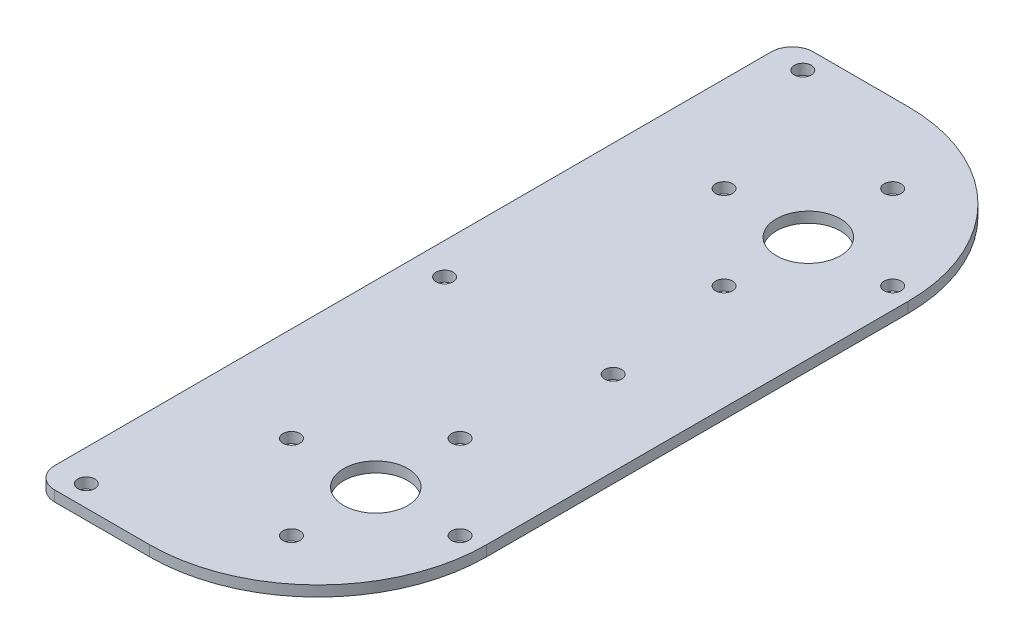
from build123d import *

# Parameters (mm, degrees)
SKETCH1_R                  = 9.652
BOSS_EXTRUDE1_DEPTH        = 3.175
F_7_0_201_DIAMETER_HOLE1_D = 5.1054
F_7_0_201_DIAMETER_HOLE2_D = 5.1054
CUT_EXTRUDE1_DEPTH         = 248.670351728
FILLET1_R                  = 6.35


with BuildPart() as part:
    # Sketch1 → Boss-Extrude1 (new body)
    with BuildSketch(Plane(origin=(0, 0, 0), x_dir=(1, 0, 0), z_dir=(0, 1, 0))):
        with BuildLine():
            Line((0, 6.35), (0, 222.25))
            ThreePointArc((0, 222.25), (1.859871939, 226.740128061), (6.35, 228.6))
            Line((6.35, 228.6), (44.45, 228.6))
            ThreePointArc((44.45, 228.6), (80.371024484, 213.721024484), (95.25, 177.8))
            Line((95.25, 177.8), (95.25, 50.8))
            ThreePointArc((95.25, 50.8), (80.371024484, 14.878975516), (44.45, 0))
            Line((44.45, 0), (6.35, 0))
            ThreePointArc((6.35, 0), (1.859871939, 1.859871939), (0, 6.35))
        make_face()
        with Locations(Location((63.5, 179.4764, 0), (0, 0, 270))):
            Circle(SKETCH1_R, mode=Mode.SUBTRACT)
        with Locations(Location((63.5, 49.1236, 0), (0, 0, 270))):
            Circle(SKETCH1_R, mode=Mode.SUBTRACT)
    extrude(amount=BOSS_EXTRUDE1_DEPTH)

    # 7 _0.201_ Diameter Hole1 (through all)
    with Locations(Plane(origin=(0, 3.175, 0), x_dir=(1, 0, 0), z_dir=(0, 1, 0))):
        with Locations((6.35, 222.25), (19.05, 222.25), (19.05, 114.3), (69.85, 114.3), (6.35, 6.35), (19.05, 6.35)):
            Hole(F_7_0_201_DIAMETER_HOLE1_D / 2)

    # 7 _0.201_ Diameter Hole2 (through all)
    with Locations(Plane(origin=(0, 3.175, 0), x_dir=(1, 0, 0), z_dir=(0, 1, 0))):
        with Locations((63.5, 204.8764), (38.1, 179.4764), (88.9, 179.4764), (63.5, 154.0764), (63.5, 74.5236), (38.1, 49.1236), (88.9, 49.1236), (63.5, 23.7236)):
            Hole(F_7_0_201_DIAMETER_HOLE2_D / 2)

    # Sketch6 → Cut-Extrude1 (cut, through all)
    with BuildSketch(Plane(origin=(0, 3.175, 0), x_dir=(1, 0, 0), z_dir=(0, 1, 0))):
        with BuildLine():
            Line((9.525, 228.6), (9.525, 0))
            Line((9.525, 0), (6.35, 0))
            ThreePointArc((6.35, 0), (1.859871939, 1.859871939), (0, 6.35))
            Line((0, 6.35), (0, 222.25))
            ThreePointArc((0, 222.25), (1.859871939, 226.740128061), (6.35, 228.6))
            Line((6.35, 228.6), (9.525, 228.6))
        make_face()
    extrude(amount=-CUT_EXTRUDE1_DEPTH, mode=Mode.SUBTRACT)

    # Fillet1
    fillet1_edges = [part.edges().sort_by_distance(p)[0] for p in [
        (9.525, 1.5875, -228.6),
        (9.525, 1.5875, 0),
    ]]
    fillet(fillet1_edges, radius=FILLET1_R)


solid = part.part
